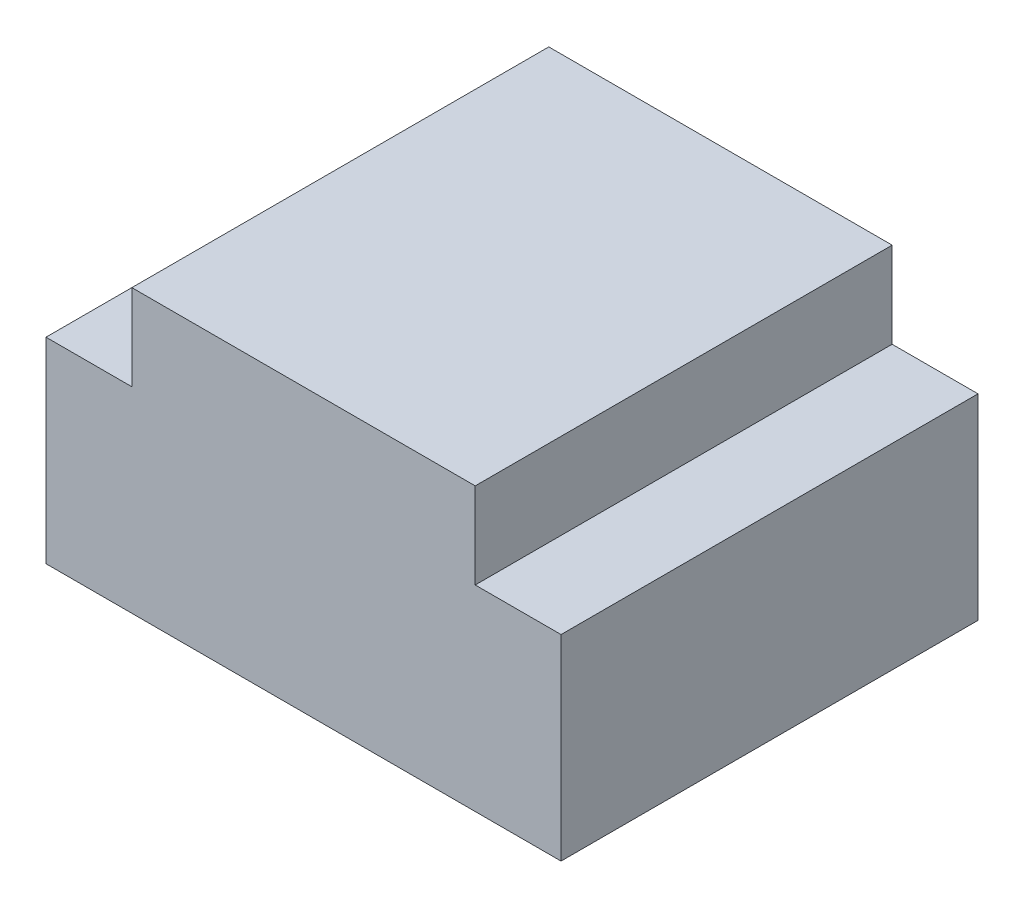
from build123d import *

# Parameters (mm, degrees)
ESQUISSE1_W      = 42
ESQUISSE1_H      = 34
EXTRUSION1_DEPTH = 16
ESQUISSE2_W      = 28
ESQUISSE2_H      = 34
EXTRUSION2_DEPTH = 7
ESQUISSE3_W      = 28
ESQUISSE3_H      = 20
EXTRUSION3_DEPTH = 6.5


with BuildPart() as part:
    # Esquisse1 → Extrusion1 (new body)
    with BuildSketch(Plane(origin=(0, 0, 0), x_dir=(1, 0, 0), z_dir=(0, 1, 0))):
        with Locations((-14.633623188, 8.105507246)):
            Rectangle(ESQUISSE1_W, ESQUISSE1_H)
    extrude(amount=EXTRUSION1_DEPTH)

    # Esquisse2 → Extrusion2 (add)
    with BuildSketch(Plane(origin=(0, 16, 0), x_dir=(-1, 0, 0), z_dir=(0, 1, 0))):
        with Locations((14.633623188, -8.105507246)):
            Rectangle(ESQUISSE2_W, ESQUISSE2_H)
    extrude(amount=EXTRUSION2_DEPTH)

    # Esquisse3 → Extrusion3 (add)
    with BuildSketch(Plane.XZ):
        with Locations((-14.633623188, -8.105507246)):
            Rectangle(ESQUISSE3_W, ESQUISSE3_H)
    extrude(amount=EXTRUSION3_DEPTH)


solid = part.part
